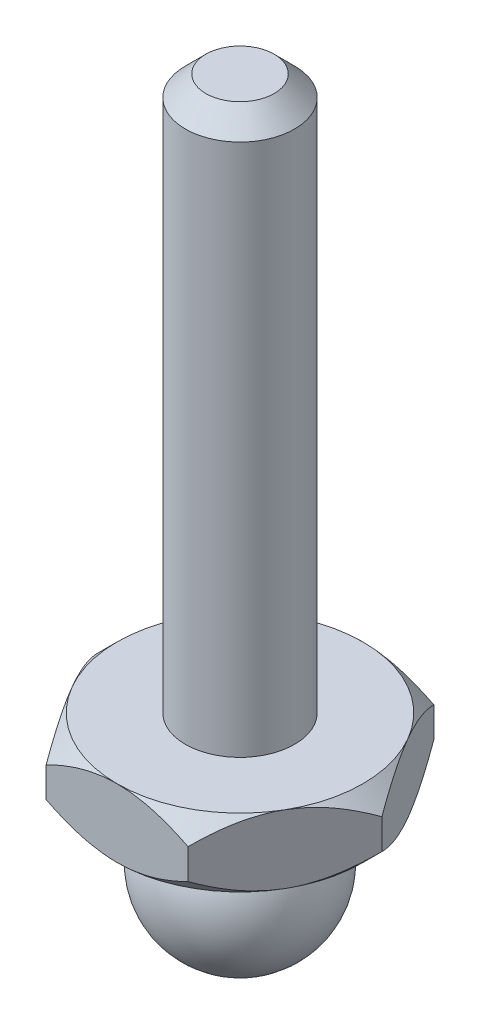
ISO-10303-21;
HEADER;
FILE_DESCRIPTION(('STEP AP214'),'2;1');
FILE_NAME('part.step','',(''),(''),'','','');
FILE_SCHEMA(('AUTOMOTIVE_DESIGN { 1 0 10303 214 1 1 1 1 }'));
ENDSEC;
DATA;
#1=APPLICATION_CONTEXT('core data for automotive mechanical design processes');
#2=APPLICATION_PROTOCOL_DEFINITION('international standard','automotive_design',2000,#1);
#3=PRODUCT_CONTEXT('',#1,'mechanical');
#4=PRODUCT('Part','Part','',(#3));
#5=PRODUCT_RELATED_PRODUCT_CATEGORY('part','',(#4));
#6=PRODUCT_DEFINITION_FORMATION('','',#4);
#7=PRODUCT_DEFINITION_CONTEXT('part definition',#1,'design');
#8=PRODUCT_DEFINITION('design','',#6,#7);
#9=PRODUCT_DEFINITION_SHAPE('','',#8);
#10=(LENGTH_UNIT() NAMED_UNIT(*) SI_UNIT(.MILLI.,.METRE.));
#11=(NAMED_UNIT(*) PLANE_ANGLE_UNIT() SI_UNIT($,.RADIAN.));
#12=(NAMED_UNIT(*) SI_UNIT($,.STERADIAN.) SOLID_ANGLE_UNIT());
#13=UNCERTAINTY_MEASURE_WITH_UNIT(LENGTH_MEASURE(1.E-05),#10,'distance_accuracy_value','');
#14=(GEOMETRIC_REPRESENTATION_CONTEXT(3) GLOBAL_UNCERTAINTY_ASSIGNED_CONTEXT((#13)) GLOBAL_UNIT_ASSIGNED_CONTEXT((#10,
#11,#12)) REPRESENTATION_CONTEXT('',''));
#15=CARTESIAN_POINT('',(0.,0.,0.));
#16=DIRECTION('',(0.,0.,1.));
#17=DIRECTION('',(1.,0.,0.));
#18=AXIS2_PLACEMENT_3D('',#15,#16,#17);
#19=CARTESIAN_POINT('',(-5.19615242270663,9.47213595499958,9.));
#20=DIRECTION('',(0.,0.,-1.));
#21=DIRECTION('',(-1.,0.,0.));
#22=AXIS2_PLACEMENT_3D('',#19,#20,#21);
#23=PLANE('',#22);
#24=CARTESIAN_POINT('',(-11.0908342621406,9.75522401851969,9.));
#25=CARTESIAN_POINT('',(-10.8238091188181,9.54792490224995,9.));
#26=CARTESIAN_POINT('',(-10.5553736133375,9.34241445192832,9.));
#27=CARTESIAN_POINT('',(-10.0150955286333,8.93579607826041,9.));
#28=CARTESIAN_POINT('',(-9.7432521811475,8.7346891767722,9.));
#29=CARTESIAN_POINT('',(-9.19358931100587,8.33627339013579,9.));
#30=CARTESIAN_POINT('',(-8.91573991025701,8.13900559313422,9.));
#31=CARTESIAN_POINT('',(-8.35546693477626,7.75109935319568,9.));
#32=CARTESIAN_POINT('',(-8.07304367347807,7.56046045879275,9.));
#33=CARTESIAN_POINT('',(-7.48382620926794,7.17490199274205,9.));
#34=CARTESIAN_POINT('',(-7.17666248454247,6.98054431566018,9.));
#35=CARTESIAN_POINT('',(-6.55510796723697,6.60354914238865,9.));
#36=CARTESIAN_POINT('',(-6.24071593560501,6.42091367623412,9.));
#37=CARTESIAN_POINT('',(-5.60456120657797,6.07122564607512,9.));
#38=CARTESIAN_POINT('',(-5.28282380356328,5.90412742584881,9.));
#39=CARTESIAN_POINT('',(-4.63010105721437,5.58925831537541,9.));
#40=CARTESIAN_POINT('',(-4.29912025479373,5.44147813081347,9.));
#41=CARTESIAN_POINT('',(-3.66309366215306,5.18516526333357,9.));
#42=CARTESIAN_POINT('',(-3.35906917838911,5.07412385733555,9.));
#43=CARTESIAN_POINT('',(-2.74306331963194,4.8763581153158,9.));
#44=CARTESIAN_POINT('',(-2.43108145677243,4.78963527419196,9.));
#45=CARTESIAN_POINT('',(-1.80658766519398,4.64673760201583,9.));
#46=CARTESIAN_POINT('',(-1.4942087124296,4.58999155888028,9.));
#47=CARTESIAN_POINT('',(-0.865298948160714,4.50826824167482,9.));
#48=CARTESIAN_POINT('',(-0.548769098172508,4.48328373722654,9.));
#49=CARTESIAN_POINT('',(0.0699839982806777,4.46734839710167,9.));
#50=CARTESIAN_POINT('',(0.372166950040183,4.47482599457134,9.00000000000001));
#51=CARTESIAN_POINT('',(0.974283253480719,4.51973478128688,9.00000000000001));
#52=CARTESIAN_POINT('',(1.27421640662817,4.55716858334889,9.00000000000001));
#53=CARTESIAN_POINT('',(1.87475535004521,4.66047166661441,9.00000000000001));
#54=CARTESIAN_POINT('',(2.17527160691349,4.72685243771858,9.00000000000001));
#55=CARTESIAN_POINT('',(2.76964399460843,4.88429361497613,9.00000000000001));
#56=CARTESIAN_POINT('',(3.06350040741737,4.97535297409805,9.00000000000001));
#57=CARTESIAN_POINT('',(3.65606933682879,5.18226022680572,9.00000000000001));
#58=CARTESIAN_POINT('',(3.95447213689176,5.2989845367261,9.00000000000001));
#59=CARTESIAN_POINT('',(4.54362888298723,5.55050580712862,9.00000000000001));
#60=CARTESIAN_POINT('',(4.83437935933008,5.68531080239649,9.00000000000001));
#61=CARTESIAN_POINT('',(5.40958599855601,5.96979946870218,9.00000000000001));
#62=CARTESIAN_POINT('',(5.69401950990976,6.1195285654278,9.00000000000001));
#63=CARTESIAN_POINT('',(6.25637904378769,6.43057648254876,9.00000000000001));
#64=CARTESIAN_POINT('',(6.53430604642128,6.59189354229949,9.00000000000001));
#65=CARTESIAN_POINT('',(7.07094073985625,6.91568090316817,9.00000000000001));
#66=CARTESIAN_POINT('',(7.32992057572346,7.07770254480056,9.00000000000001));
#67=CARTESIAN_POINT('',(7.84342991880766,7.40867133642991,9.00000000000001));
#68=CARTESIAN_POINT('',(8.09795909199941,7.57761900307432,9.00000000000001));
#69=CARTESIAN_POINT('',(8.60111065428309,7.91983863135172,9.00000000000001));
#70=CARTESIAN_POINT('',(8.84976398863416,8.09306525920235,9.00000000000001));
#71=CARTESIAN_POINT('',(9.3436551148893,8.44418417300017,9.00000000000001));
#72=CARTESIAN_POINT('',(9.58889382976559,8.62207515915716,9.00000000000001));
#73=CARTESIAN_POINT('',(9.83269925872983,8.80187618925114,9.00000000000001));
#74=B_SPLINE_CURVE_WITH_KNOTS('',3,(#24,#25,#26,#27,#28,#29,#30,#31,#32,#33,#34,#35,#36,#37,#38,
#39,#40,#41,#42,#43,#44,#45,#46,#47,#48,#49,#50,#51,#52,#53,#54,#55,#56,#57,#58,#59,#60,#61,#62,
#63,#64,#65,#66,#67,#68,#69,#70,#71,#72,#73),.UNSPECIFIED.,.F.,.F.,(4,2,2,2,2,2,2,2,2,2,2,2,2,2,
2,2,2,2,2,2,2,2,2,2,4),(0.,1.01415701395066,2.02854692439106,3.05073583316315,4.07285498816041,
5.16311489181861,6.25356309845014,7.3406984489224,8.42730881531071,9.39748376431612,
10.3677183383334,11.3187293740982,12.2695238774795,13.1748150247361,14.0801851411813,
15.0022458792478,15.9242675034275,16.8847951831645,17.8457511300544,18.8097269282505,
19.7735565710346,20.6898849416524,21.6062817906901,22.5153570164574,23.4241815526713),.UNSPECIFIED.);
#75=CARTESIAN_POINT('',(5.19615242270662,5.86444080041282,9.00000000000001));
#76=VERTEX_POINT('',#75);
#77=CARTESIAN_POINT('',(0.,4.47213595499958,9.00000000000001));
#78=VERTEX_POINT('',#77);
#79=EDGE_CURVE('E137',#76,#78,#74,.F.);
#80=ORIENTED_EDGE('',*,*,#79,.F.);
#81=DIRECTION('',(0.,-1.,0.));
#82=VECTOR('',#81,1.);
#83=CARTESIAN_POINT('',(5.19615242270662,9.47213595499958,9.00000000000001));
#84=LINE('',#83,#82);
#85=CARTESIAN_POINT('',(5.19615242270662,8.07983110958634,9.00000000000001));
#86=VERTEX_POINT('',#85);
#87=EDGE_CURVE('E465',#86,#76,#84,.T.);
#88=ORIENTED_EDGE('',*,*,#87,.F.);
#89=CARTESIAN_POINT('',(-11.0908342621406,4.18904789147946,9.));
#90=CARTESIAN_POINT('',(-10.8238091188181,4.39634700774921,9.));
#91=CARTESIAN_POINT('',(-10.5553736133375,4.60185745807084,9.));
#92=CARTESIAN_POINT('',(-10.0150955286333,5.00847583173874,9.));
#93=CARTESIAN_POINT('',(-9.7432521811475,5.20958273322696,9.));
#94=CARTESIAN_POINT('',(-9.19358931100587,5.60799851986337,9.));
#95=CARTESIAN_POINT('',(-8.91573991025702,5.80526631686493,9.));
#96=CARTESIAN_POINT('',(-8.35546693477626,6.19317255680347,9.));
#97=CARTESIAN_POINT('',(-8.07304367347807,6.3838114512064,9.));
#98=CARTESIAN_POINT('',(-7.48382620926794,6.76936991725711,9.));
#99=CARTESIAN_POINT('',(-7.17666248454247,6.96372759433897,9.));
#100=CARTESIAN_POINT('',(-6.55510796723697,7.34072276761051,9.));
#101=CARTESIAN_POINT('',(-6.24071593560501,7.52335823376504,9.));
#102=CARTESIAN_POINT('',(-5.60456120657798,7.87304626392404,9.));
#103=CARTESIAN_POINT('',(-5.28282380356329,8.04014448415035,9.));
#104=CARTESIAN_POINT('',(-4.63010105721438,8.35501359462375,9.));
#105=CARTESIAN_POINT('',(-4.29912025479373,8.50279377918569,9.));
#106=CARTESIAN_POINT('',(-3.66309366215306,8.75910664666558,9.));
#107=CARTESIAN_POINT('',(-3.35906917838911,8.87014805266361,9.));
#108=CARTESIAN_POINT('',(-2.74306331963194,9.06791379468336,9.));
#109=CARTESIAN_POINT('',(-2.43108145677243,9.1546366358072,9.));
#110=CARTESIAN_POINT('',(-1.80658766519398,9.29753430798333,9.));
#111=CARTESIAN_POINT('',(-1.49420871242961,9.35428035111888,9.));
#112=CARTESIAN_POINT('',(-0.865298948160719,9.43600366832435,9.));
#113=CARTESIAN_POINT('',(-0.548769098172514,9.46098817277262,9.));
#114=CARTESIAN_POINT('',(0.0699839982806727,9.47692351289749,9.));
#115=CARTESIAN_POINT('',(0.372166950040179,9.46944591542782,9.00000000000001));
#116=CARTESIAN_POINT('',(0.974283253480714,9.42453712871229,9.00000000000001));
#117=CARTESIAN_POINT('',(1.27421640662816,9.38710332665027,9.00000000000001));
#118=CARTESIAN_POINT('',(1.87475535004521,9.28380024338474,9.00000000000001));
#119=CARTESIAN_POINT('',(2.17527160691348,9.21741947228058,9.00000000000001));
#120=CARTESIAN_POINT('',(2.76964399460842,9.05997829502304,9.00000000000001));
#121=CARTESIAN_POINT('',(3.06350040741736,8.96891893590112,9.00000000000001));
#122=CARTESIAN_POINT('',(3.65606933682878,8.76201168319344,9.00000000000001));
#123=CARTESIAN_POINT('',(3.95447213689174,8.64528737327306,9.00000000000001));
#124=CARTESIAN_POINT('',(4.54362888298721,8.39376610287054,9.00000000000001));
#125=CARTESIAN_POINT('',(4.83437935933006,8.25896110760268,9.00000000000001));
#126=CARTESIAN_POINT('',(5.40958599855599,7.97447244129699,9.00000000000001));
#127=CARTESIAN_POINT('',(5.69401950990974,7.82474334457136,9.00000000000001));
#128=CARTESIAN_POINT('',(6.25637904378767,7.51369542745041,9.00000000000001));
#129=CARTESIAN_POINT('',(6.53430604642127,7.35237836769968,9.00000000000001));
#130=CARTESIAN_POINT('',(7.07094073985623,7.028591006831,9.00000000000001));
#131=CARTESIAN_POINT('',(7.32992057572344,6.86656936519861,9.00000000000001));
#132=CARTESIAN_POINT('',(7.84342991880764,6.53560057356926,9.00000000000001));
#133=CARTESIAN_POINT('',(8.09795909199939,6.36665290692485,9.00000000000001));
#134=CARTESIAN_POINT('',(8.60111065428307,6.02443327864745,9.00000000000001));
#135=CARTESIAN_POINT('',(8.84976398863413,5.85120665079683,9.00000000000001));
#136=CARTESIAN_POINT('',(9.34365511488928,5.50008773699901,9.00000000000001));
#137=CARTESIAN_POINT('',(9.58889382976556,5.32219675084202,9.00000000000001));
#138=CARTESIAN_POINT('',(9.83269925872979,5.14239572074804,9.00000000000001));
#139=B_SPLINE_CURVE_WITH_KNOTS('',3,(#89,#90,#91,#92,#93,#94,#95,#96,#97,#98,#99,#100,#101,#102,
#103,#104,#105,#106,#107,#108,#109,#110,#111,#112,#113,#114,#115,#116,#117,#118,#119,#120,#121,
#122,#123,#124,#125,#126,#127,#128,#129,#130,#131,#132,#133,#134,#135,#136,#137,#138),
.UNSPECIFIED.,.F.,.F.,(4,2,2,2,2,2,2,2,2,2,2,2,2,2,2,2,2,2,2,2,2,2,2,2,4),(0.,1.01415701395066,
2.02854692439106,3.05073583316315,4.07285498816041,5.1631148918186,6.25356309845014,
7.3406984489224,8.42730881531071,9.39748376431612,10.3677183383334,11.3187293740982,
12.2695238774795,13.1748150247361,14.0801851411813,15.0022458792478,15.9242675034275,
16.8847951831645,17.8457511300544,18.8097269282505,19.7735565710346,20.6898849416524,
21.6062817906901,22.5153570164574,23.4241815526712),.UNSPECIFIED.);
#140=CARTESIAN_POINT('',(0.,9.47213595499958,9.));
#141=VERTEX_POINT('',#140);
#142=EDGE_CURVE('E440',#141,#86,#139,.T.);
#143=ORIENTED_EDGE('',*,*,#142,.F.);
#144=CARTESIAN_POINT('',(-5.19615242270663,8.07983110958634,9.));
#145=VERTEX_POINT('',#144);
#146=EDGE_CURVE('E438',#145,#141,#139,.T.);
#147=ORIENTED_EDGE('',*,*,#146,.F.);
#148=DIRECTION('',(0.,-1.,0.));
#149=VECTOR('',#148,1.);
#150=CARTESIAN_POINT('',(-5.19615242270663,9.47213595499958,9.));
#151=LINE('',#150,#149);
#152=CARTESIAN_POINT('',(-5.19615242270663,5.86444080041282,9.));
#153=VERTEX_POINT('',#152);
#154=EDGE_CURVE('E149',#145,#153,#151,.T.);
#155=ORIENTED_EDGE('',*,*,#154,.T.);
#156=EDGE_CURVE('E124',#78,#153,#74,.F.);
#157=ORIENTED_EDGE('',*,*,#156,.F.);
#158=EDGE_LOOP('',(#80,#88,#143,#147,#155,#157));
#159=FACE_BOUND('',#158,.T.);
#160=ADVANCED_FACE('F30',(#159),#23,.F.);
#161=CARTESIAN_POINT('',(-10.3923048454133,9.47213595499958,0.));
#162=DIRECTION('',(0.866025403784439,0.,-0.5));
#163=DIRECTION('',(-0.5,0.,-0.866025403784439));
#164=AXIS2_PLACEMENT_3D('',#161,#162,#163);
#165=PLANE('',#164);
#166=CARTESIAN_POINT('',(-5.19603695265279,5.86455627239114,9.0002));
#167=CARTESIAN_POINT('',(-5.28537108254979,5.77523459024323,8.84546874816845));
#168=CARTESIAN_POINT('',(-5.37540484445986,5.68863850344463,8.68952569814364));
#169=CARTESIAN_POINT('',(-5.5569805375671,5.52176331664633,8.37502737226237));
#170=CARTESIAN_POINT('',(-5.64852325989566,5.44148766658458,8.21647072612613));
#171=CARTESIAN_POINT('',(-5.83365756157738,5.28777917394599,7.89580870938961));
#172=CARTESIAN_POINT('',(-5.92725787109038,5.21438814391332,7.73368821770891));
#173=CARTESIAN_POINT('',(-6.11599584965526,5.07604288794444,7.4067844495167));
#174=CARTESIAN_POINT('',(-6.21113328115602,5.01108737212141,7.24200158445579));
#175=CARTESIAN_POINT('',(-6.40141583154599,4.89166836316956,6.91242253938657));
#176=CARTESIAN_POINT('',(-6.49653756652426,4.83705668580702,6.74766686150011));
#177=CARTESIAN_POINT('',(-6.68811448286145,4.73818723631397,6.41584590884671));
#178=CARTESIAN_POINT('',(-6.78456951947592,4.69392834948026,6.24878088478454));
#179=CARTESIAN_POINT('',(-6.97840046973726,4.6168787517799,5.91305583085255));
#180=CARTESIAN_POINT('',(-7.07577379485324,4.58406222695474,5.74440028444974));
#181=CARTESIAN_POINT('',(-7.2713379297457,4.53061845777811,5.40567326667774));
#182=CARTESIAN_POINT('',(-7.36952861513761,4.50998939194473,5.23560201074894));
#183=CARTESIAN_POINT('',(-7.60881036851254,4.47540033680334,4.82115385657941));
#184=CARTESIAN_POINT('',(-7.75016006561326,4.46814177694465,4.57632899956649));
#185=CARTESIAN_POINT('',(-8.03260382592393,4.4803246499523,4.08712205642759));
#186=CARTESIAN_POINT('',(-8.17369778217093,4.4997754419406,3.84274015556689));
#187=CARTESIAN_POINT('',(-8.45455567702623,4.56422892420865,3.35628001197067));
#188=CARTESIAN_POINT('',(-8.5943179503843,4.60926018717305,3.11420465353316));
#189=CARTESIAN_POINT('',(-8.87144025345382,4.72242685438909,2.63421474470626));
#190=CARTESIAN_POINT('',(-9.00880046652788,4.7905604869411,2.3962998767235));
#191=CARTESIAN_POINT('',(-9.25263415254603,4.93072902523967,1.97396754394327));
#192=CARTESIAN_POINT('',(-9.35964764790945,4.99907688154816,1.78861473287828));
#193=CARTESIAN_POINT('',(-9.57175371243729,5.1467861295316,1.42123625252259));
#194=CARTESIAN_POINT('',(-9.67684622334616,5.22614785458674,1.23921068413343));
#195=CARTESIAN_POINT('',(-9.88477930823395,5.39410596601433,0.879060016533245));
#196=CARTESIAN_POINT('',(-9.9876257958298,5.48267331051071,0.700924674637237));
#197=CARTESIAN_POINT('',(-10.1914144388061,5.66787999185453,0.34795239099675));
#198=CARTESIAN_POINT('',(-10.2923577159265,5.76451437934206,0.173113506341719));
#199=CARTESIAN_POINT('',(-10.3924203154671,5.86455627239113,-0.000200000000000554));
#200=B_SPLINE_CURVE_WITH_KNOTS('',3,(#166,#167,#168,#169,#170,#171,#172,#173,#174,#175,#176,
#177,#178,#179,#180,#181,#182,#183,#184,#185,#186,#187,#188,#189,#190,#191,#192,#193,#194,#195,
#196,#197,#198,#199),.UNSPECIFIED.,.F.,.F.,(4,2,2,2,2,2,2,2,2,2,2,2,2,2,2,2,4),(0.,
0.599280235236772,1.19888534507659,1.80192368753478,2.40486970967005,2.99838724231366,
3.59184084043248,4.18394681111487,4.77596426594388,5.62301971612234,6.47037205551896,
7.31867273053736,8.16690836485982,8.84061799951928,9.51434803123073,10.1860136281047,
10.8572701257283),.UNSPECIFIED.);
#201=CARTESIAN_POINT('',(-7.79422863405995,4.47213595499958,4.49999999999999));
#202=VERTEX_POINT('',#201);
#203=EDGE_CURVE('E126',#153,#202,#200,.T.);
#204=ORIENTED_EDGE('',*,*,#203,.F.);
#205=ORIENTED_EDGE('',*,*,#154,.F.);
#206=CARTESIAN_POINT('',(-10.3924203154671,8.07971563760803,-0.000200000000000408));
#207=CARTESIAN_POINT('',(-10.3030861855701,8.16903731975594,0.154531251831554));
#208=CARTESIAN_POINT('',(-10.21305242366,8.25563340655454,0.310474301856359));
#209=CARTESIAN_POINT('',(-10.0314767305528,8.42250859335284,0.624972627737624));
#210=CARTESIAN_POINT('',(-9.93993400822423,8.50278424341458,0.783529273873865));
#211=CARTESIAN_POINT('',(-9.75479970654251,8.65649273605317,1.10419129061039));
#212=CARTESIAN_POINT('',(-9.66119939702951,8.72988376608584,1.26631178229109));
#213=CARTESIAN_POINT('',(-9.47246141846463,8.86822902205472,1.59321555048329));
#214=CARTESIAN_POINT('',(-9.37732398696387,8.93318453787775,1.75799841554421));
#215=CARTESIAN_POINT('',(-9.18704143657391,9.0526035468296,2.08757746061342));
#216=CARTESIAN_POINT('',(-9.09191970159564,9.10721522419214,2.25233313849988));
#217=CARTESIAN_POINT('',(-8.90034278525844,9.20608467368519,2.58415409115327));
#218=CARTESIAN_POINT('',(-8.80388774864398,9.2503435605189,2.75121911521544));
#219=CARTESIAN_POINT('',(-8.61005679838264,9.32739315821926,3.08694416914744));
#220=CARTESIAN_POINT('',(-8.51268347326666,9.36020968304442,3.25559971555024));
#221=CARTESIAN_POINT('',(-8.31711933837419,9.41365345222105,3.59432673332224));
#222=CARTESIAN_POINT('',(-8.21892865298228,9.43428251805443,3.76439798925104));
#223=CARTESIAN_POINT('',(-7.97964689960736,9.46887157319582,4.17884614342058));
#224=CARTESIAN_POINT('',(-7.83829720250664,9.47613013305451,4.42367100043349));
#225=CARTESIAN_POINT('',(-7.55585344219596,9.46394726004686,4.91287794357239));
#226=CARTESIAN_POINT('',(-7.41475948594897,9.44449646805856,5.15725984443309));
#227=CARTESIAN_POINT('',(-7.13390159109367,9.38004298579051,5.64371998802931));
#228=CARTESIAN_POINT('',(-6.99413931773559,9.33501172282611,5.88579534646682));
#229=CARTESIAN_POINT('',(-6.71701701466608,9.22184505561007,6.36578525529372));
#230=CARTESIAN_POINT('',(-6.57965680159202,9.15371142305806,6.60370012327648));
#231=CARTESIAN_POINT('',(-6.33582311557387,9.01354288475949,7.02603245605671));
#232=CARTESIAN_POINT('',(-6.22880962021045,8.945195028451,7.2113852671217));
#233=CARTESIAN_POINT('',(-6.01670355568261,8.79748578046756,7.5787637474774));
#234=CARTESIAN_POINT('',(-5.91161104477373,8.71812405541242,7.76078931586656));
#235=CARTESIAN_POINT('',(-5.70367795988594,8.55016594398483,8.12093998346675));
#236=CARTESIAN_POINT('',(-5.60083147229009,8.46159859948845,8.29907532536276));
#237=CARTESIAN_POINT('',(-5.39704282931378,8.27639191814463,8.65204760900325));
#238=CARTESIAN_POINT('',(-5.29609955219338,8.17975753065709,8.82688649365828));
#239=CARTESIAN_POINT('',(-5.19603695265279,8.07971563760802,9.0002));
#240=B_SPLINE_CURVE_WITH_KNOTS('',3,(#206,#207,#208,#209,#210,#211,#212,#213,#214,#215,#216,
#217,#218,#219,#220,#221,#222,#223,#224,#225,#226,#227,#228,#229,#230,#231,#232,#233,#234,#235,
#236,#237,#238,#239),.UNSPECIFIED.,.F.,.F.,(4,2,2,2,2,2,2,2,2,2,2,2,2,2,2,2,4),(0.,
0.59928023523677,1.19888534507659,1.80192368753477,2.40486970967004,2.99838724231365,
3.59184084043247,4.18394681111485,4.77596426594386,5.62301971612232,6.47037205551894,
7.31867273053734,8.16690836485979,8.84061799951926,9.51434803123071,10.1860136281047,
10.8572701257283),.UNSPECIFIED.);
#241=CARTESIAN_POINT('',(-7.79422863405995,9.47213595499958,4.49999999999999));
#242=VERTEX_POINT('',#241);
#243=EDGE_CURVE('E216',#242,#145,#240,.T.);
#244=ORIENTED_EDGE('',*,*,#243,.F.);
#245=CARTESIAN_POINT('',(-10.3923048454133,8.07983110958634,0.));
#246=VERTEX_POINT('',#245);
#247=EDGE_CURVE('E221',#246,#242,#240,.T.);
#248=ORIENTED_EDGE('',*,*,#247,.F.);
#249=DIRECTION('',(0.,-1.,0.));
#250=VECTOR('',#249,1.);
#251=CARTESIAN_POINT('',(-10.3923048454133,9.47213595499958,0.));
#252=LINE('',#251,#250);
#253=CARTESIAN_POINT('',(-10.3923048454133,5.86444080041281,0.));
#254=VERTEX_POINT('',#253);
#255=EDGE_CURVE('E461',#246,#254,#252,.T.);
#256=ORIENTED_EDGE('',*,*,#255,.T.);
#257=EDGE_CURVE('E195',#202,#254,#200,.T.);
#258=ORIENTED_EDGE('',*,*,#257,.F.);
#259=EDGE_LOOP('',(#204,#205,#244,#248,#256,#258));
#260=FACE_BOUND('',#259,.T.);
#261=ADVANCED_FACE('F206',(#260),#165,.F.);
#262=CARTESIAN_POINT('',(-5.19615242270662,9.47213595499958,-9.));
#263=DIRECTION('',(0.866025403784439,0.,0.5));
#264=DIRECTION('',(0.5,0.,-0.866025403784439));
#265=AXIS2_PLACEMENT_3D('',#262,#263,#264);
#266=PLANE('',#265);
#267=CARTESIAN_POINT('',(-10.3924203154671,5.86455627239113,0.000199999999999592));
#268=CARTESIAN_POINT('',(-10.3030861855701,5.77523459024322,-0.154531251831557));
#269=CARTESIAN_POINT('',(-10.21305242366,5.68863850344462,-0.310474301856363));
#270=CARTESIAN_POINT('',(-10.0314767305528,5.52176331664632,-0.624972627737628));
#271=CARTESIAN_POINT('',(-9.93993400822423,5.44148766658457,-0.783529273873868));
#272=CARTESIAN_POINT('',(-9.75479970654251,5.28777917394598,-1.10419129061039));
#273=CARTESIAN_POINT('',(-9.6611993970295,5.21438814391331,-1.26631178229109));
#274=CARTESIAN_POINT('',(-9.47246141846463,5.07604288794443,-1.5932155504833));
#275=CARTESIAN_POINT('',(-9.37732398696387,5.0110873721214,-1.75799841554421));
#276=CARTESIAN_POINT('',(-9.1870414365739,4.89166836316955,-2.08757746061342));
#277=CARTESIAN_POINT('',(-9.09191970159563,4.83705668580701,-2.25233313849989));
#278=CARTESIAN_POINT('',(-8.90034278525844,4.73818723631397,-2.58415409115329));
#279=CARTESIAN_POINT('',(-8.80388774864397,4.69392834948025,-2.75121911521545));
#280=CARTESIAN_POINT('',(-8.61005679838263,4.6168787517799,-3.08694416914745));
#281=CARTESIAN_POINT('',(-8.51268347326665,4.58406222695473,-3.25559971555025));
#282=CARTESIAN_POINT('',(-8.31711933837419,4.5306184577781,-3.59432673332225));
#283=CARTESIAN_POINT('',(-8.21892865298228,4.50998939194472,-3.76439798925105));
#284=CARTESIAN_POINT('',(-7.97964689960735,4.47540033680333,-4.17884614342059));
#285=CARTESIAN_POINT('',(-7.83829720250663,4.46814177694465,-4.4236710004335));
#286=CARTESIAN_POINT('',(-7.55585344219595,4.48032464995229,-4.91287794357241));
#287=CARTESIAN_POINT('',(-7.41475948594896,4.4997754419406,-5.1572598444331));
#288=CARTESIAN_POINT('',(-7.13390159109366,4.56422892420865,-5.64371998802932));
#289=CARTESIAN_POINT('',(-6.99413931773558,4.60926018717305,-5.88579534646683));
#290=CARTESIAN_POINT('',(-6.71701701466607,4.72242685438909,-6.36578525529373));
#291=CARTESIAN_POINT('',(-6.57965680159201,4.7905604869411,-6.60370012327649));
#292=CARTESIAN_POINT('',(-6.33582311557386,4.93072902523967,-7.02603245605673));
#293=CARTESIAN_POINT('',(-6.22880962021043,4.99907688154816,-7.21138526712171));
#294=CARTESIAN_POINT('',(-6.0167035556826,5.1467861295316,-7.57876374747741));
#295=CARTESIAN_POINT('',(-5.91161104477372,5.22614785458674,-7.76078931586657));
#296=CARTESIAN_POINT('',(-5.70367795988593,5.39410596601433,-8.12093998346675));
#297=CARTESIAN_POINT('',(-5.60083147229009,5.48267331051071,-8.29907532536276));
#298=CARTESIAN_POINT('',(-5.39704282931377,5.66787999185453,-8.65204760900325));
#299=CARTESIAN_POINT('',(-5.29609955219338,5.76451437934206,-8.82688649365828));
#300=CARTESIAN_POINT('',(-5.19603695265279,5.86455627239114,-9.0002));
#301=B_SPLINE_CURVE_WITH_KNOTS('',3,(#267,#268,#269,#270,#271,#272,#273,#274,#275,#276,#277,
#278,#279,#280,#281,#282,#283,#284,#285,#286,#287,#288,#289,#290,#291,#292,#293,#294,#295,#296,
#297,#298,#299,#300),.UNSPECIFIED.,.F.,.F.,(4,2,2,2,2,2,2,2,2,2,2,2,2,2,2,2,4),(0.,
0.599280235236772,1.19888534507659,1.80192368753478,2.40486970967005,2.99838724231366,
3.59184084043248,4.18394681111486,4.77596426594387,5.62301971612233,6.47037205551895,
7.31867273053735,8.16690836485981,8.84061799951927,9.51434803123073,10.1860136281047,
10.8572701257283),.UNSPECIFIED.);
#302=CARTESIAN_POINT('',(-7.79422863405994,4.47213595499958,-4.5));
#303=VERTEX_POINT('',#302);
#304=EDGE_CURVE('E200',#254,#303,#301,.T.);
#305=ORIENTED_EDGE('',*,*,#304,.F.);
#306=ORIENTED_EDGE('',*,*,#255,.F.);
#307=CARTESIAN_POINT('',(-5.19603695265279,8.07971563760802,-9.0002));
#308=CARTESIAN_POINT('',(-5.28537108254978,8.16903731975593,-8.84546874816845));
#309=CARTESIAN_POINT('',(-5.37540484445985,8.25563340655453,-8.68952569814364));
#310=CARTESIAN_POINT('',(-5.55698053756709,8.42250859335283,-8.37502737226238));
#311=CARTESIAN_POINT('',(-5.64852325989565,8.50278424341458,-8.21647072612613));
#312=CARTESIAN_POINT('',(-5.83365756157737,8.65649273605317,-7.89580870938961));
#313=CARTESIAN_POINT('',(-5.92725787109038,8.72988376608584,-7.73368821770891));
#314=CARTESIAN_POINT('',(-6.11599584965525,8.86822902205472,-7.4067844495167));
#315=CARTESIAN_POINT('',(-6.21113328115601,8.93318453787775,-7.24200158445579));
#316=CARTESIAN_POINT('',(-6.40141583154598,9.0526035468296,-6.91242253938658));
#317=CARTESIAN_POINT('',(-6.49653756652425,9.10721522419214,-6.74766686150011));
#318=CARTESIAN_POINT('',(-6.68811448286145,9.20608467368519,-6.41584590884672));
#319=CARTESIAN_POINT('',(-6.78456951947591,9.2503435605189,-6.24878088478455));
#320=CARTESIAN_POINT('',(-6.97840046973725,9.32739315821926,-5.91305583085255));
#321=CARTESIAN_POINT('',(-7.07577379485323,9.36020968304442,-5.74440028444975));
#322=CARTESIAN_POINT('',(-7.2713379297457,9.41365345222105,-5.40567326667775));
#323=CARTESIAN_POINT('',(-7.3695286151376,9.43428251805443,-5.23560201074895));
#324=CARTESIAN_POINT('',(-7.60881036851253,9.46887157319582,-4.82115385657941));
#325=CARTESIAN_POINT('',(-7.75016006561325,9.47613013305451,-4.5763289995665));
#326=CARTESIAN_POINT('',(-8.03260382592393,9.46394726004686,-4.0871220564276));
#327=CARTESIAN_POINT('',(-8.17369778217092,9.44449646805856,-3.8427401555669));
#328=CARTESIAN_POINT('',(-8.45455567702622,9.38004298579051,-3.35628001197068));
#329=CARTESIAN_POINT('',(-8.5943179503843,9.33501172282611,-3.11420465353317));
#330=CARTESIAN_POINT('',(-8.87144025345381,9.22184505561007,-2.63421474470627));
#331=CARTESIAN_POINT('',(-9.00880046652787,9.15371142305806,-2.39629987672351));
#332=CARTESIAN_POINT('',(-9.25263415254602,9.01354288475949,-1.97396754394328));
#333=CARTESIAN_POINT('',(-9.35964764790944,8.945195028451,-1.78861473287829));
#334=CARTESIAN_POINT('',(-9.57175371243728,8.79748578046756,-1.4212362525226));
#335=CARTESIAN_POINT('',(-9.67684622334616,8.71812405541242,-1.23921068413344));
#336=CARTESIAN_POINT('',(-9.88477930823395,8.55016594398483,-0.879060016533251));
#337=CARTESIAN_POINT('',(-9.98762579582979,8.46159859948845,-0.700924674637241));
#338=CARTESIAN_POINT('',(-10.1914144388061,8.27639191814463,-0.347952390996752));
#339=CARTESIAN_POINT('',(-10.2923577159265,8.1797575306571,-0.17311350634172));
#340=CARTESIAN_POINT('',(-10.3924203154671,8.07971563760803,0.000199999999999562));
#341=B_SPLINE_CURVE_WITH_KNOTS('',3,(#307,#308,#309,#310,#311,#312,#313,#314,#315,#316,#317,
#318,#319,#320,#321,#322,#323,#324,#325,#326,#327,#328,#329,#330,#331,#332,#333,#334,#335,#336,
#337,#338,#339,#340),.UNSPECIFIED.,.F.,.F.,(4,2,2,2,2,2,2,2,2,2,2,2,2,2,2,2,4),(0.,
0.599280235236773,1.19888534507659,1.80192368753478,2.40486970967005,2.99838724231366,
3.59184084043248,4.18394681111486,4.77596426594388,5.62301971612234,6.47037205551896,
7.31867273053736,8.16690836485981,8.84061799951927,9.51434803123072,10.1860136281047,
10.8572701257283),.UNSPECIFIED.);
#342=CARTESIAN_POINT('',(-7.79422863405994,9.47213595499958,-4.5));
#343=VERTEX_POINT('',#342);
#344=EDGE_CURVE('E223',#343,#246,#341,.T.);
#345=ORIENTED_EDGE('',*,*,#344,.F.);
#346=CARTESIAN_POINT('',(-5.19615242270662,8.07983110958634,-9.));
#347=VERTEX_POINT('',#346);
#348=EDGE_CURVE('E228',#347,#343,#341,.T.);
#349=ORIENTED_EDGE('',*,*,#348,.F.);
#350=DIRECTION('',(0.,-1.,0.));
#351=VECTOR('',#350,1.);
#352=CARTESIAN_POINT('',(-5.19615242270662,9.47213595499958,-9.));
#353=LINE('',#352,#351);
#354=CARTESIAN_POINT('',(-5.19615242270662,5.86444080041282,-9.));
#355=VERTEX_POINT('',#354);
#356=EDGE_CURVE('E458',#347,#355,#353,.T.);
#357=ORIENTED_EDGE('',*,*,#356,.T.);
#358=EDGE_CURVE('E189',#303,#355,#301,.T.);
#359=ORIENTED_EDGE('',*,*,#358,.F.);
#360=EDGE_LOOP('',(#305,#306,#345,#349,#357,#359));
#361=FACE_BOUND('',#360,.T.);
#362=ADVANCED_FACE('F209',(#361),#266,.F.);
#363=CARTESIAN_POINT('',(5.19615242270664,9.47213595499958,-9.));
#364=DIRECTION('',(0.,0.,1.));
#365=DIRECTION('',(1.,0.,0.));
#366=AXIS2_PLACEMENT_3D('',#363,#364,#365);
#367=PLANE('',#366);
#368=CARTESIAN_POINT('',(-11.0908342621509,9.75522401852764,-9.00000000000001));
#369=CARTESIAN_POINT('',(-10.8238091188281,9.54792490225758,-9.00000000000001));
#370=CARTESIAN_POINT('',(-10.5553736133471,9.34241445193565,-9.00000000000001));
#371=CARTESIAN_POINT('',(-10.0150955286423,8.93579607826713,-9.00000000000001));
#372=CARTESIAN_POINT('',(-9.74325218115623,8.73468917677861,-9.00000000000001));
#373=CARTESIAN_POINT('',(-9.19358931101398,8.33627339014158,-9.00000000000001));
#374=CARTESIAN_POINT('',(-8.91573991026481,8.13900559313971,-9.00000000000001));
#375=CARTESIAN_POINT('',(-8.35546693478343,7.75109935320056,-9.00000000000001));
#376=CARTESIAN_POINT('',(-8.07304367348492,7.56046045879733,-9.00000000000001));
#377=CARTESIAN_POINT('',(-7.4838262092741,7.17490199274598,-9.00000000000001));
#378=CARTESIAN_POINT('',(-7.17666248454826,6.98054431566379,-9.00000000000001));
#379=CARTESIAN_POINT('',(-6.555107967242,6.60354914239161,-9.00000000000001));
#380=CARTESIAN_POINT('',(-6.24071593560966,6.42091367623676,-9.));
#381=CARTESIAN_POINT('',(-5.60456120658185,6.07122564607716,-9.));
#382=CARTESIAN_POINT('',(-5.28282380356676,5.90412742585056,-9.));
#383=CARTESIAN_POINT('',(-4.63010105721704,5.58925831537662,-9.));
#384=CARTESIAN_POINT('',(-4.29912025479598,5.44147813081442,-9.));
#385=CARTESIAN_POINT('',(-3.66309366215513,5.18516526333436,-9.));
#386=CARTESIAN_POINT('',(-3.35906917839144,5.07412385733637,-9.));
#387=CARTESIAN_POINT('',(-2.74306331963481,4.87635811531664,-9.));
#388=CARTESIAN_POINT('',(-2.43108145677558,4.78963527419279,-9.));
#389=CARTESIAN_POINT('',(-1.80658766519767,4.64673760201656,-9.));
#390=CARTESIAN_POINT('',(-1.49420871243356,4.58999155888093,-9.));
#391=CARTESIAN_POINT('',(-0.865298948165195,4.50826824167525,-9.));
#392=CARTESIAN_POINT('',(-0.548769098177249,4.48328373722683,-9.));
#393=CARTESIAN_POINT('',(0.0699839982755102,4.46734839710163,-9.));
#394=CARTESIAN_POINT('',(0.372166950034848,4.47482599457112,-9.));
#395=CARTESIAN_POINT('',(0.974283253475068,4.51973478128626,-9.));
#396=CARTESIAN_POINT('',(1.27421640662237,4.55716858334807,-9.));
#397=CARTESIAN_POINT('',(1.87475535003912,4.66047166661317,-9.));
#398=CARTESIAN_POINT('',(2.17527160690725,4.72685243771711,-9.));
#399=CARTESIAN_POINT('',(2.76964399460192,4.8842936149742,-9.));
#400=CARTESIAN_POINT('',(3.06350040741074,4.9753529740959,-9.));
#401=CARTESIAN_POINT('',(3.65606933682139,5.18226022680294,-9.));
#402=CARTESIAN_POINT('',(3.95447213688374,5.29898453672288,-9.));
#403=CARTESIAN_POINT('',(4.543628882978,5.55050580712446,-9.));
#404=CARTESIAN_POINT('',(4.83437935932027,5.68531080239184,-9.));
#405=CARTESIAN_POINT('',(5.40958599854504,5.96979946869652,-9.));
#406=CARTESIAN_POINT('',(5.69401950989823,6.11952856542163,-9.));
#407=CARTESIAN_POINT('',(6.25637904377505,6.43057648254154,-9.));
#408=CARTESIAN_POINT('',(6.5343060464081,6.59189354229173,-8.99999999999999));
#409=CARTESIAN_POINT('',(7.07094073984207,6.9156809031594,-8.99999999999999));
#410=CARTESIAN_POINT('',(7.32992057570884,7.07770254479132,-8.99999999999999));
#411=CARTESIAN_POINT('',(7.84342991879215,7.4086713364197,-8.99999999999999));
#412=CARTESIAN_POINT('',(8.09795909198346,7.57761900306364,-8.99999999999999));
#413=CARTESIAN_POINT('',(8.60111065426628,7.91983863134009,-8.99999999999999));
#414=CARTESIAN_POINT('',(8.84976398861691,8.09306525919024,-8.99999999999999));
#415=CARTESIAN_POINT('',(9.3436551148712,8.44418417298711,-8.99999999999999));
#416=CARTESIAN_POINT('',(9.58889382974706,8.62207515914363,-8.99999999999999));
#417=CARTESIAN_POINT('',(9.83269925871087,8.80187618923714,-8.99999999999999));
#418=B_SPLINE_CURVE_WITH_KNOTS('',3,(#368,#369,#370,#371,#372,#373,#374,#375,#376,#377,#378,
#379,#380,#381,#382,#383,#384,#385,#386,#387,#388,#389,#390,#391,#392,#393,#394,#395,#396,#397,
#398,#399,#400,#401,#402,#403,#404,#405,#406,#407,#408,#409,#410,#411,#412,#413,#414,#415,#416,
#417),.UNSPECIFIED.,.F.,.F.,(4,2,2,2,2,2,2,2,2,2,2,2,2,2,2,2,2,2,2,2,2,2,2,2,4),(0.,
1.01415701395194,2.02854692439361,3.050735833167,4.07285498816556,5.16311489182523,
6.25356309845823,7.34069844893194,8.42730881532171,9.39748376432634,10.3677183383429,
11.3187293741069,12.2695238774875,13.1748150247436,14.0801851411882,15.0022458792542,
15.9242675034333,16.8847951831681,17.8457511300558,18.8097269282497,19.7735565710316,
20.6898849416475,21.6062817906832,22.5153570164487,23.4241815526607),.UNSPECIFIED.);
#419=CARTESIAN_POINT('',(0.,4.47213595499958,-9.));
#420=VERTEX_POINT('',#419);
#421=EDGE_CURVE('E510',#355,#420,#418,.T.);
#422=ORIENTED_EDGE('',*,*,#421,.F.);
#423=ORIENTED_EDGE('',*,*,#356,.F.);
#424=CARTESIAN_POINT('',(-11.0908342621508,4.18904789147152,-9.00000000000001));
#425=CARTESIAN_POINT('',(-10.8238091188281,4.39634700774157,-9.00000000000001));
#426=CARTESIAN_POINT('',(-10.5553736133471,4.60185745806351,-9.00000000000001));
#427=CARTESIAN_POINT('',(-10.0150955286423,5.00847583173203,-9.00000000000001));
#428=CARTESIAN_POINT('',(-9.74325218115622,5.20958273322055,-9.00000000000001));
#429=CARTESIAN_POINT('',(-9.19358931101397,5.60799851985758,-9.00000000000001));
#430=CARTESIAN_POINT('',(-8.9157399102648,5.80526631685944,-9.00000000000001));
#431=CARTESIAN_POINT('',(-8.35546693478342,6.1931725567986,-9.00000000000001));
#432=CARTESIAN_POINT('',(-8.07304367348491,6.38381145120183,-9.00000000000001));
#433=CARTESIAN_POINT('',(-7.48382620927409,6.76936991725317,-9.00000000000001));
#434=CARTESIAN_POINT('',(-7.17666248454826,6.96372759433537,-9.00000000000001));
#435=CARTESIAN_POINT('',(-6.555107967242,7.34072276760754,-9.00000000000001));
#436=CARTESIAN_POINT('',(-6.24071593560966,7.52335823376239,-9.));
#437=CARTESIAN_POINT('',(-5.60456120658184,7.87304626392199,-9.));
#438=CARTESIAN_POINT('',(-5.28282380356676,8.04014448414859,-9.));
#439=CARTESIAN_POINT('',(-4.63010105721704,8.35501359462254,-9.));
#440=CARTESIAN_POINT('',(-4.29912025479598,8.50279377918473,-9.));
#441=CARTESIAN_POINT('',(-3.66309366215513,8.7591066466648,-9.));
#442=CARTESIAN_POINT('',(-3.35906917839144,8.87014805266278,-9.));
#443=CARTESIAN_POINT('',(-2.74306331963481,9.06791379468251,-9.));
#444=CARTESIAN_POINT('',(-2.43108145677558,9.15463663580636,-9.));
#445=CARTESIAN_POINT('',(-1.80658766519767,9.29753430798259,-9.));
#446=CARTESIAN_POINT('',(-1.49420871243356,9.35428035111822,-9.));
#447=CARTESIAN_POINT('',(-0.8652989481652,9.43600366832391,-9.));
#448=CARTESIAN_POINT('',(-0.548769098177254,9.46098817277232,-9.));
#449=CARTESIAN_POINT('',(0.0699839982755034,9.47692351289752,-9.));
#450=CARTESIAN_POINT('',(0.37216695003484,9.46944591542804,-9.));
#451=CARTESIAN_POINT('',(0.974283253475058,9.42453712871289,-9.));
#452=CARTESIAN_POINT('',(1.27421640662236,9.38710332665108,-9.));
#453=CARTESIAN_POINT('',(1.87475535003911,9.28380024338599,-9.));
#454=CARTESIAN_POINT('',(2.17527160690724,9.21741947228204,-9.));
#455=CARTESIAN_POINT('',(2.76964399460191,9.05997829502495,-9.));
#456=CARTESIAN_POINT('',(3.06350040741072,8.96891893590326,-9.));
#457=CARTESIAN_POINT('',(3.65606933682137,8.76201168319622,-9.));
#458=CARTESIAN_POINT('',(3.95447213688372,8.64528737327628,-9.));
#459=CARTESIAN_POINT('',(4.54362888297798,8.3937661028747,-9.));
#460=CARTESIAN_POINT('',(4.83437935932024,8.25896110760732,-9.));
#461=CARTESIAN_POINT('',(5.40958599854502,7.97447244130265,-9.));
#462=CARTESIAN_POINT('',(5.6940195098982,7.82474334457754,-9.));
#463=CARTESIAN_POINT('',(6.25637904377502,7.51369542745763,-9.));
#464=CARTESIAN_POINT('',(6.53430604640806,7.35237836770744,-8.99999999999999));
#465=CARTESIAN_POINT('',(7.07094073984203,7.02859100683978,-8.99999999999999));
#466=CARTESIAN_POINT('',(7.32992057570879,6.86656936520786,-8.99999999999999));
#467=CARTESIAN_POINT('',(7.8434299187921,6.53560057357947,-8.99999999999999));
#468=CARTESIAN_POINT('',(8.09795909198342,6.36665290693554,-8.99999999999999));
#469=CARTESIAN_POINT('',(8.60111065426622,6.02443327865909,-8.99999999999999));
#470=CARTESIAN_POINT('',(8.84976398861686,5.85120665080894,-8.99999999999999));
#471=CARTESIAN_POINT('',(9.34365511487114,5.50008773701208,-8.99999999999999));
#472=CARTESIAN_POINT('',(9.588893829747,5.32219675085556,-8.99999999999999));
#473=CARTESIAN_POINT('',(9.83269925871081,5.14239572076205,-8.99999999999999));
#474=B_SPLINE_CURVE_WITH_KNOTS('',3,(#424,#425,#426,#427,#428,#429,#430,#431,#432,#433,#434,
#435,#436,#437,#438,#439,#440,#441,#442,#443,#444,#445,#446,#447,#448,#449,#450,#451,#452,#453,
#454,#455,#456,#457,#458,#459,#460,#461,#462,#463,#464,#465,#466,#467,#468,#469,#470,#471,#472,
#473),.UNSPECIFIED.,.F.,.F.,(4,2,2,2,2,2,2,2,2,2,2,2,2,2,2,2,2,2,2,2,2,2,2,2,4),(0.,
1.01415701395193,2.02854692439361,3.05073583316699,4.07285498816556,5.16311489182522,
6.25356309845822,7.34069844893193,8.4273088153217,9.39748376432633,10.3677183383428,
11.3187293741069,12.2695238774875,13.1748150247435,14.0801851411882,15.0022458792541,
15.9242675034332,16.8847951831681,17.8457511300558,18.8097269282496,19.7735565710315,
20.6898849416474,21.6062817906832,22.5153570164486,23.4241815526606),.UNSPECIFIED.);
#475=CARTESIAN_POINT('',(0.,9.47213595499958,-9.));
#476=VERTEX_POINT('',#475);
#477=EDGE_CURVE('E229',#476,#347,#474,.F.);
#478=ORIENTED_EDGE('',*,*,#477,.F.);
#479=CARTESIAN_POINT('',(5.19615242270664,8.07983110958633,-9.));
#480=VERTEX_POINT('',#479);
#481=EDGE_CURVE('E234',#480,#476,#474,.F.);
#482=ORIENTED_EDGE('',*,*,#481,.F.);
#483=DIRECTION('',(0.,-1.,0.));
#484=VECTOR('',#483,1.);
#485=CARTESIAN_POINT('',(5.19615242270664,9.47213595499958,-9.));
#486=LINE('',#485,#484);
#487=CARTESIAN_POINT('',(5.19615242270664,5.86444080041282,-9.));
#488=VERTEX_POINT('',#487);
#489=EDGE_CURVE('E455',#480,#488,#486,.T.);
#490=ORIENTED_EDGE('',*,*,#489,.T.);
#491=EDGE_CURVE('E162',#420,#488,#418,.T.);
#492=ORIENTED_EDGE('',*,*,#491,.F.);
#493=EDGE_LOOP('',(#422,#423,#478,#482,#490,#492));
#494=FACE_BOUND('',#493,.T.);
#495=ADVANCED_FACE('F240',(#494),#367,.F.);
#496=CARTESIAN_POINT('',(10.3923048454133,9.47213595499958,0.));
#497=DIRECTION('',(-0.866025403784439,0.,0.499999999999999));
#498=DIRECTION('',(0.499999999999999,0.,0.866025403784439));
#499=AXIS2_PLACEMENT_3D('',#496,#497,#498);
#500=PLANE('',#499);
#501=CARTESIAN_POINT('',(5.1960369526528,5.86455627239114,-9.0002));
#502=CARTESIAN_POINT('',(5.2853710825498,5.77523459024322,-8.84546874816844));
#503=CARTESIAN_POINT('',(5.37540484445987,5.68863850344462,-8.68952569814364));
#504=CARTESIAN_POINT('',(5.5569805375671,5.52176331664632,-8.37502737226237));
#505=CARTESIAN_POINT('',(5.64852325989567,5.44148766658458,-8.21647072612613));
#506=CARTESIAN_POINT('',(5.83365756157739,5.28777917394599,-7.89580870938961));
#507=CARTESIAN_POINT('',(5.92725787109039,5.21438814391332,-7.73368821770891));
#508=CARTESIAN_POINT('',(6.11599584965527,5.07604288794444,-7.4067844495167));
#509=CARTESIAN_POINT('',(6.21113328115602,5.01108737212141,-7.24200158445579));
#510=CARTESIAN_POINT('',(6.40141583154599,4.89166836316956,-6.91242253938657));
#511=CARTESIAN_POINT('',(6.49653756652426,4.83705668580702,-6.74766686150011));
#512=CARTESIAN_POINT('',(6.68811448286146,4.73818723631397,-6.41584590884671));
#513=CARTESIAN_POINT('',(6.78456951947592,4.69392834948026,-6.24878088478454));
#514=CARTESIAN_POINT('',(6.97840046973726,4.6168787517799,-5.91305583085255));
#515=CARTESIAN_POINT('',(7.07577379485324,4.58406222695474,-5.74440028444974));
#516=CARTESIAN_POINT('',(7.27133792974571,4.53061845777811,-5.40567326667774));
#517=CARTESIAN_POINT('',(7.36952861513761,4.50998939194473,-5.23560201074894));
#518=CARTESIAN_POINT('',(7.60881036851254,4.47540033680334,-4.82115385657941));
#519=CARTESIAN_POINT('',(7.75016006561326,4.46814177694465,-4.57632899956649));
#520=CARTESIAN_POINT('',(8.03260382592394,4.4803246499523,-4.08712205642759));
#521=CARTESIAN_POINT('',(8.17369778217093,4.4997754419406,-3.8427401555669));
#522=CARTESIAN_POINT('',(8.45455567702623,4.56422892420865,-3.35628001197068));
#523=CARTESIAN_POINT('',(8.59431795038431,4.60926018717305,-3.11420465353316));
#524=CARTESIAN_POINT('',(8.87144025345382,4.72242685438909,-2.63421474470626));
#525=CARTESIAN_POINT('',(9.00880046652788,4.7905604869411,-2.3962998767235));
#526=CARTESIAN_POINT('',(9.25263415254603,4.93072902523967,-1.97396754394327));
#527=CARTESIAN_POINT('',(9.35964764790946,4.99907688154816,-1.78861473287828));
#528=CARTESIAN_POINT('',(9.57175371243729,5.1467861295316,-1.42123625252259));
#529=CARTESIAN_POINT('',(9.67684622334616,5.22614785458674,-1.23921068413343));
#530=CARTESIAN_POINT('',(9.88477930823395,5.39410596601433,-0.879060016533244));
#531=CARTESIAN_POINT('',(9.9876257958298,5.48267331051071,-0.700924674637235));
#532=CARTESIAN_POINT('',(10.1914144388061,5.66787999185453,-0.347952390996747));
#533=CARTESIAN_POINT('',(10.2923577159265,5.76451437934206,-0.173113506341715));
#534=CARTESIAN_POINT('',(10.3924203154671,5.86455627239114,0.000200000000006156));
#535=B_SPLINE_CURVE_WITH_KNOTS('',3,(#501,#502,#503,#504,#505,#506,#507,#508,#509,#510,#511,
#512,#513,#514,#515,#516,#517,#518,#519,#520,#521,#522,#523,#524,#525,#526,#527,#528,#529,#530,
#531,#532,#533,#534),.UNSPECIFIED.,.F.,.F.,(4,2,2,2,2,2,2,2,2,2,2,2,2,2,2,2,4),(0.,
0.599280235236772,1.19888534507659,1.80192368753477,2.40486970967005,2.99838724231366,
3.59184084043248,4.18394681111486,4.77596426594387,5.62301971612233,6.47037205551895,
7.31867273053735,8.16690836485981,8.84061799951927,9.51434803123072,10.1860136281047,
10.8572701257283),.UNSPECIFIED.);
#536=CARTESIAN_POINT('',(7.79422863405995,4.47213595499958,-4.49999999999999));
#537=VERTEX_POINT('',#536);
#538=EDGE_CURVE('E161',#488,#537,#535,.T.);
#539=ORIENTED_EDGE('',*,*,#538,.F.);
#540=ORIENTED_EDGE('',*,*,#489,.F.);
#541=CARTESIAN_POINT('',(10.3924203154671,8.07971563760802,0.000200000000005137));
#542=CARTESIAN_POINT('',(10.3030861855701,8.16903731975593,-0.15453125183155));
#543=CARTESIAN_POINT('',(10.21305242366,8.25563340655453,-0.310474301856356));
#544=CARTESIAN_POINT('',(10.0314767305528,8.42250859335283,-0.624972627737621));
#545=CARTESIAN_POINT('',(9.93993400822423,8.50278424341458,-0.783529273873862));
#546=CARTESIAN_POINT('',(9.75479970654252,8.65649273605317,-1.10419129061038));
#547=CARTESIAN_POINT('',(9.66119939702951,8.72988376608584,-1.26631178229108));
#548=CARTESIAN_POINT('',(9.47246141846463,8.86822902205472,-1.59321555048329));
#549=CARTESIAN_POINT('',(9.37732398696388,8.93318453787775,-1.7579984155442));
#550=CARTESIAN_POINT('',(9.18704143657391,9.0526035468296,-2.08757746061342));
#551=CARTESIAN_POINT('',(9.09191970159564,9.10721522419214,-2.25233313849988));
#552=CARTESIAN_POINT('',(8.90034278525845,9.20608467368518,-2.58415409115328));
#553=CARTESIAN_POINT('',(8.80388774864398,9.2503435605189,-2.75121911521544));
#554=CARTESIAN_POINT('',(8.61005679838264,9.32739315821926,-3.08694416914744));
#555=CARTESIAN_POINT('',(8.51268347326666,9.36020968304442,-3.25559971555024));
#556=CARTESIAN_POINT('',(8.3171193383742,9.41365345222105,-3.59432673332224));
#557=CARTESIAN_POINT('',(8.21892865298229,9.43428251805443,-3.76439798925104));
#558=CARTESIAN_POINT('',(7.97964689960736,9.46887157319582,-4.17884614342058));
#559=CARTESIAN_POINT('',(7.83829720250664,9.4761301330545,-4.42367100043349));
#560=CARTESIAN_POINT('',(7.55585344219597,9.46394726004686,-4.9128779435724));
#561=CARTESIAN_POINT('',(7.41475948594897,9.44449646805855,-5.15725984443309));
#562=CARTESIAN_POINT('',(7.13390159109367,9.3800429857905,-5.64371998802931));
#563=CARTESIAN_POINT('',(6.9941393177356,9.3350117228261,-5.88579534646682));
#564=CARTESIAN_POINT('',(6.71701701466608,9.22184505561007,-6.36578525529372));
#565=CARTESIAN_POINT('',(6.57965680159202,9.15371142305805,-6.60370012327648));
#566=CARTESIAN_POINT('',(6.33582311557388,9.01354288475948,-7.02603245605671));
#567=CARTESIAN_POINT('',(6.22880962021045,8.94519502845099,-7.2113852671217));
#568=CARTESIAN_POINT('',(6.01670355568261,8.79748578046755,-7.5787637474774));
#569=CARTESIAN_POINT('',(5.91161104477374,8.71812405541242,-7.76078931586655));
#570=CARTESIAN_POINT('',(5.70367795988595,8.55016594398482,-8.12093998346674));
#571=CARTESIAN_POINT('',(5.6008314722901,8.46159859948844,-8.29907532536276));
#572=CARTESIAN_POINT('',(5.39704282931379,8.27639191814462,-8.65204760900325));
#573=CARTESIAN_POINT('',(5.29609955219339,8.17975753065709,-8.82688649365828));
#574=CARTESIAN_POINT('',(5.1960369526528,8.07971563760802,-9.0002));
#575=B_SPLINE_CURVE_WITH_KNOTS('',3,(#541,#542,#543,#544,#545,#546,#547,#548,#549,#550,#551,
#552,#553,#554,#555,#556,#557,#558,#559,#560,#561,#562,#563,#564,#565,#566,#567,#568,#569,#570,
#571,#572,#573,#574),.UNSPECIFIED.,.F.,.F.,(4,2,2,2,2,2,2,2,2,2,2,2,2,2,2,2,4),(0.,
0.599280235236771,1.19888534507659,1.80192368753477,2.40486970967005,2.99838724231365,
3.59184084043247,4.18394681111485,4.77596426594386,5.62301971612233,6.47037205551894,
7.31867273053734,8.16690836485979,8.84061799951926,9.51434803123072,10.1860136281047,
10.8572701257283),.UNSPECIFIED.);
#576=CARTESIAN_POINT('',(7.79422863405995,9.47213595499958,-4.49999999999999));
#577=VERTEX_POINT('',#576);
#578=EDGE_CURVE('E235',#577,#480,#575,.T.);
#579=ORIENTED_EDGE('',*,*,#578,.F.);
#580=CARTESIAN_POINT('',(10.3923048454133,8.07983110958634,0.));
#581=VERTEX_POINT('',#580);
#582=EDGE_CURVE('E471',#581,#577,#575,.T.);
#583=ORIENTED_EDGE('',*,*,#582,.F.);
#584=DIRECTION('',(0.,-1.,0.));
#585=VECTOR('',#584,1.);
#586=CARTESIAN_POINT('',(10.3923048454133,9.47213595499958,0.));
#587=LINE('',#586,#585);
#588=CARTESIAN_POINT('',(10.3923048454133,5.86444080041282,0.));
#589=VERTEX_POINT('',#588);
#590=EDGE_CURVE('E450',#581,#589,#587,.T.);
#591=ORIENTED_EDGE('',*,*,#590,.T.);
#592=EDGE_CURVE('E154',#537,#589,#535,.T.);
#593=ORIENTED_EDGE('',*,*,#592,.F.);
#594=EDGE_LOOP('',(#539,#540,#579,#583,#591,#593));
#595=FACE_BOUND('',#594,.T.);
#596=ADVANCED_FACE('F168',(#595),#500,.F.);
#597=CARTESIAN_POINT('',(5.19615242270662,9.47213595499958,9.00000000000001));
#598=DIRECTION('',(-0.866025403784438,0.,-0.5));
#599=DIRECTION('',(-0.5,0.,0.866025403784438));
#600=AXIS2_PLACEMENT_3D('',#597,#598,#599);
#601=PLANE('',#600);
#602=CARTESIAN_POINT('',(10.3924203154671,5.86455627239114,-0.000199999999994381));
#603=CARTESIAN_POINT('',(10.3030861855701,5.77523459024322,0.15453125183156));
#604=CARTESIAN_POINT('',(10.21305242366,5.68863850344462,0.310474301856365));
#605=CARTESIAN_POINT('',(10.0314767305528,5.52176331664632,0.624972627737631));
#606=CARTESIAN_POINT('',(9.93993400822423,5.44148766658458,0.783529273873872));
#607=CARTESIAN_POINT('',(9.75479970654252,5.28777917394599,1.10419129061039));
#608=CARTESIAN_POINT('',(9.66119939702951,5.21438814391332,1.26631178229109));
#609=CARTESIAN_POINT('',(9.47246141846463,5.07604288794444,1.5932155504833));
#610=CARTESIAN_POINT('',(9.37732398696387,5.01108737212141,1.75799841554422));
#611=CARTESIAN_POINT('',(9.1870414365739,4.89166836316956,2.08757746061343));
#612=CARTESIAN_POINT('',(9.09191970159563,4.83705668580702,2.25233313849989));
#613=CARTESIAN_POINT('',(8.90034278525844,4.73818723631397,2.58415409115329));
#614=CARTESIAN_POINT('',(8.80388774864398,4.69392834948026,2.75121911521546));
#615=CARTESIAN_POINT('',(8.61005679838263,4.6168787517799,3.08694416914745));
#616=CARTESIAN_POINT('',(8.51268347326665,4.58406222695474,3.25559971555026));
#617=CARTESIAN_POINT('',(8.31711933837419,4.53061845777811,3.59432673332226));
#618=CARTESIAN_POINT('',(8.21892865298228,4.50998939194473,3.76439798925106));
#619=CARTESIAN_POINT('',(7.97964689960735,4.47540033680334,4.17884614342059));
#620=CARTESIAN_POINT('',(7.83829720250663,4.46814177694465,4.42367100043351));
#621=CARTESIAN_POINT('',(7.55585344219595,4.4803246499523,4.91287794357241));
#622=CARTESIAN_POINT('',(7.41475948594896,4.4997754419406,5.1572598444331));
#623=CARTESIAN_POINT('',(7.13390159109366,4.56422892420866,5.64371998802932));
#624=CARTESIAN_POINT('',(6.99413931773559,4.60926018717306,5.88579534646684));
#625=CARTESIAN_POINT('',(6.71701701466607,4.72242685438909,6.36578525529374));
#626=CARTESIAN_POINT('',(6.57965680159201,4.7905604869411,6.6037001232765));
#627=CARTESIAN_POINT('',(6.33582311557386,4.93072902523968,7.02603245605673));
#628=CARTESIAN_POINT('',(6.22880962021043,4.99907688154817,7.21138526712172));
#629=CARTESIAN_POINT('',(6.0167035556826,5.14678612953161,7.57876374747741));
#630=CARTESIAN_POINT('',(5.91161104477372,5.22614785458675,7.76078931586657));
#631=CARTESIAN_POINT('',(5.70367795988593,5.39410596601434,8.12093998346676));
#632=CARTESIAN_POINT('',(5.60083147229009,5.48267331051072,8.29907532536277));
#633=CARTESIAN_POINT('',(5.39704282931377,5.66787999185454,8.65204760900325));
#634=CARTESIAN_POINT('',(5.29609955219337,5.76451437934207,8.82688649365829));
#635=CARTESIAN_POINT('',(5.19603695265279,5.86455627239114,9.00020000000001));
#636=B_SPLINE_CURVE_WITH_KNOTS('',3,(#602,#603,#604,#605,#606,#607,#608,#609,#610,#611,#612,
#613,#614,#615,#616,#617,#618,#619,#620,#621,#622,#623,#624,#625,#626,#627,#628,#629,#630,#631,
#632,#633,#634,#635),.UNSPECIFIED.,.F.,.F.,(4,2,2,2,2,2,2,2,2,2,2,2,2,2,2,2,4),(0.,
0.599280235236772,1.19888534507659,1.80192368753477,2.40486970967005,2.99838724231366,
3.59184084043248,4.18394681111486,4.77596426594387,5.62301971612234,6.47037205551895,
7.31867273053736,8.16690836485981,8.84061799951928,9.51434803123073,10.1860136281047,
10.8572701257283),.UNSPECIFIED.);
#637=CARTESIAN_POINT('',(7.79422863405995,4.47213595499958,4.5));
#638=VERTEX_POINT('',#637);
#639=EDGE_CURVE('E436',#589,#638,#636,.T.);
#640=ORIENTED_EDGE('',*,*,#639,.F.);
#641=ORIENTED_EDGE('',*,*,#590,.F.);
#642=CARTESIAN_POINT('',(5.19603695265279,8.07971563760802,9.00020000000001));
#643=CARTESIAN_POINT('',(5.28537108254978,8.16903731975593,8.84546874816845));
#644=CARTESIAN_POINT('',(5.37540484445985,8.25563340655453,8.68952569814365));
#645=CARTESIAN_POINT('',(5.55698053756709,8.42250859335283,8.37502737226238));
#646=CARTESIAN_POINT('',(5.64852325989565,8.50278424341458,8.21647072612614));
#647=CARTESIAN_POINT('',(5.83365756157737,8.65649273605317,7.89580870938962));
#648=CARTESIAN_POINT('',(5.92725787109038,8.72988376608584,7.73368821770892));
#649=CARTESIAN_POINT('',(6.11599584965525,8.86822902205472,7.40678444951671));
#650=CARTESIAN_POINT('',(6.21113328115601,8.93318453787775,7.2420015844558));
#651=CARTESIAN_POINT('',(6.40141583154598,9.0526035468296,6.91242253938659));
#652=CARTESIAN_POINT('',(6.49653756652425,9.10721522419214,6.74766686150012));
#653=CARTESIAN_POINT('',(6.68811448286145,9.20608467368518,6.41584590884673));
#654=CARTESIAN_POINT('',(6.78456951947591,9.2503435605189,6.24878088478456));
#655=CARTESIAN_POINT('',(6.97840046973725,9.32739315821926,5.91305583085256));
#656=CARTESIAN_POINT('',(7.07577379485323,9.36020968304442,5.74440028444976));
#657=CARTESIAN_POINT('',(7.2713379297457,9.41365345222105,5.40567326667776));
#658=CARTESIAN_POINT('',(7.3695286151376,9.43428251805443,5.23560201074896));
#659=CARTESIAN_POINT('',(7.60881036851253,9.46887157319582,4.82115385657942));
#660=CARTESIAN_POINT('',(7.75016006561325,9.47613013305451,4.57632899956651));
#661=CARTESIAN_POINT('',(8.03260382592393,9.46394726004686,4.0871220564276));
#662=CARTESIAN_POINT('',(8.17369778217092,9.44449646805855,3.84274015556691));
#663=CARTESIAN_POINT('',(8.45455567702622,9.3800429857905,3.35628001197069));
#664=CARTESIAN_POINT('',(8.5943179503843,9.33501172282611,3.11420465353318));
#665=CARTESIAN_POINT('',(8.87144025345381,9.22184505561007,2.63421474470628));
#666=CARTESIAN_POINT('',(9.00880046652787,9.15371142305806,2.39629987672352));
#667=CARTESIAN_POINT('',(9.25263415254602,9.01354288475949,1.97396754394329));
#668=CARTESIAN_POINT('',(9.35964764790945,8.945195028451,1.7886147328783));
#669=CARTESIAN_POINT('',(9.57175371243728,8.79748578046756,1.4212362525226));
#670=CARTESIAN_POINT('',(9.67684622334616,8.71812405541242,1.23921068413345));
#671=CARTESIAN_POINT('',(9.88477930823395,8.55016594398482,0.879060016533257));
#672=CARTESIAN_POINT('',(9.9876257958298,8.46159859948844,0.700924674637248));
#673=CARTESIAN_POINT('',(10.1914144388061,8.27639191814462,0.347952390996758));
#674=CARTESIAN_POINT('',(10.2923577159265,8.17975753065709,0.173113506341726));
#675=CARTESIAN_POINT('',(10.3924203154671,8.07971563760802,-0.000199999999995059));
#676=B_SPLINE_CURVE_WITH_KNOTS('',3,(#642,#643,#644,#645,#646,#647,#648,#649,#650,#651,#652,
#653,#654,#655,#656,#657,#658,#659,#660,#661,#662,#663,#664,#665,#666,#667,#668,#669,#670,#671,
#672,#673,#674,#675),.UNSPECIFIED.,.F.,.F.,(4,2,2,2,2,2,2,2,2,2,2,2,2,2,2,2,4),(0.,
0.59928023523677,1.19888534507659,1.80192368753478,2.40486970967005,2.99838724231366,
3.59184084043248,4.18394681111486,4.77596426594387,5.62301971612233,6.47037205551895,
7.31867273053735,8.1669083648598,8.84061799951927,9.51434803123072,10.1860136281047,
10.8572701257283),.UNSPECIFIED.);
#677=CARTESIAN_POINT('',(7.79422863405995,9.47213595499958,4.5));
#678=VERTEX_POINT('',#677);
#679=EDGE_CURVE('E467',#678,#581,#676,.T.);
#680=ORIENTED_EDGE('',*,*,#679,.F.);
#681=EDGE_CURVE('E466',#86,#678,#676,.T.);
#682=ORIENTED_EDGE('',*,*,#681,.F.);
#683=ORIENTED_EDGE('',*,*,#87,.T.);
#684=EDGE_CURVE('E140',#638,#76,#636,.T.);
#685=ORIENTED_EDGE('',*,*,#684,.F.);
#686=EDGE_LOOP('',(#640,#641,#680,#682,#683,#685));
#687=FACE_BOUND('',#686,.T.);
#688=ADVANCED_FACE('F249',(#687),#601,.F.);
#689=CARTESIAN_POINT('',(10.3923048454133,9.47213595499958,0.));
#690=DIRECTION('',(0.,1.,0.));
#691=DIRECTION('',(0.,0.,1.));
#692=AXIS2_PLACEMENT_3D('',#689,#690,#691);
#693=PLANE('',#692);
#694=CARTESIAN_POINT('',(0.,9.47213595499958,0.));
#695=DIRECTION('',(0.,1.,0.));
#696=DIRECTION('',(0.,0.,1.));
#697=AXIS2_PLACEMENT_3D('',#694,#695,#696);
#698=CIRCLE('',#697,4.);
#699=CARTESIAN_POINT('',(0.,9.47213595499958,4.));
#700=VERTEX_POINT('',#699);
#701=EDGE_CURVE('E447',#700,#700,#698,.T.);
#702=ORIENTED_EDGE('',*,*,#701,.F.);
#703=EDGE_LOOP('',(#702));
#704=FACE_BOUND('',#703,.T.);
#705=CARTESIAN_POINT('',(0.,9.47213595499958,0.));
#706=DIRECTION('',(0.,-1.,0.));
#707=DIRECTION('',(0.,0.,-1.));
#708=AXIS2_PLACEMENT_3D('',#705,#706,#707);
#709=CIRCLE('',#708,9.00000000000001);
#710=EDGE_CURVE('E502',#141,#242,#709,.T.);
#711=ORIENTED_EDGE('',*,*,#710,.F.);
#712=EDGE_CURVE('E500',#678,#141,#709,.T.);
#713=ORIENTED_EDGE('',*,*,#712,.F.);
#714=EDGE_CURVE('E499',#577,#678,#709,.T.);
#715=ORIENTED_EDGE('',*,*,#714,.F.);
#716=EDGE_CURVE('E222',#476,#577,#709,.T.);
#717=ORIENTED_EDGE('',*,*,#716,.F.);
#718=EDGE_CURVE('E144',#343,#476,#709,.T.);
#719=ORIENTED_EDGE('',*,*,#718,.F.);
#720=EDGE_CURVE('E501',#242,#343,#709,.T.);
#721=ORIENTED_EDGE('',*,*,#720,.F.);
#722=EDGE_LOOP('',(#711,#713,#715,#717,#719,#721));
#723=FACE_BOUND('',#722,.T.);
#724=ADVANCED_FACE('F284',(#704,#723),#693,.T.);
#725=CARTESIAN_POINT('',(0.,50.,0.));
#726=DIRECTION('',(0.,-1.,0.));
#727=DIRECTION('',(0.,0.,-1.));
#728=AXIS2_PLACEMENT_3D('',#725,#726,#727);
#729=CYLINDRICAL_SURFACE('',#728,4.);
#730=CARTESIAN_POINT('',(0.,48.5,0.));
#731=DIRECTION('',(0.,1.,0.));
#732=DIRECTION('',(0.,0.,1.));
#733=AXIS2_PLACEMENT_3D('',#730,#731,#732);
#734=CIRCLE('',#733,4.);
#735=CARTESIAN_POINT('',(0.,48.5,4.));
#736=VERTEX_POINT('',#735);
#737=EDGE_CURVE('E11',#736,#736,#734,.F.);
#738=ORIENTED_EDGE('',*,*,#737,.T.);
#739=EDGE_LOOP('',(#738));
#740=FACE_BOUND('',#739,.T.);
#741=ORIENTED_EDGE('',*,*,#701,.T.);
#742=EDGE_LOOP('',(#741));
#743=FACE_BOUND('',#742,.T.);
#744=ADVANCED_FACE('F293',(#740,#743),#729,.T.);
#745=CARTESIAN_POINT('',(0.,50.,0.));
#746=DIRECTION('',(0.,1.,0.));
#747=DIRECTION('',(0.,0.,1.));
#748=AXIS2_PLACEMENT_3D('',#745,#746,#747);
#749=PLANE('',#748);
#750=CARTESIAN_POINT('',(0.,50.,0.));
#751=DIRECTION('',(0.,1.,0.));
#752=DIRECTION('',(0.,0.,1.));
#753=AXIS2_PLACEMENT_3D('',#750,#751,#752);
#754=CIRCLE('',#753,2.5);
#755=CARTESIAN_POINT('',(0.,50.,2.5));
#756=VERTEX_POINT('',#755);
#757=EDGE_CURVE('E38',#756,#756,#754,.T.);
#758=ORIENTED_EDGE('',*,*,#757,.T.);
#759=EDGE_LOOP('',(#758));
#760=FACE_BOUND('',#759,.T.);
#761=ADVANCED_FACE('F305',(#760),#749,.T.);
#762=CARTESIAN_POINT('',(0.,7.4721359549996,0.));
#763=DIRECTION('',(0.,-1.,0.));
#764=DIRECTION('',(0.,0.,-1.));
#765=AXIS2_PLACEMENT_3D('',#762,#763,#764);
#766=CONICAL_SURFACE('',#765,11.,0.785398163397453);
#767=ORIENTED_EDGE('',*,*,#681,.T.);
#768=ORIENTED_EDGE('',*,*,#712,.T.);
#769=ORIENTED_EDGE('',*,*,#142,.T.);
#770=EDGE_LOOP('',(#767,#768,#769));
#771=FACE_BOUND('',#770,.T.);
#772=ADVANCED_FACE('F176',(#771),#766,.T.);
#773=ORIENTED_EDGE('',*,*,#243,.T.);
#774=ORIENTED_EDGE('',*,*,#146,.T.);
#775=ORIENTED_EDGE('',*,*,#710,.T.);
#776=EDGE_LOOP('',(#773,#774,#775));
#777=FACE_BOUND('',#776,.T.);
#778=ADVANCED_FACE('F304',(#777),#766,.T.);
#779=ORIENTED_EDGE('',*,*,#344,.T.);
#780=ORIENTED_EDGE('',*,*,#247,.T.);
#781=ORIENTED_EDGE('',*,*,#720,.T.);
#782=EDGE_LOOP('',(#779,#780,#781));
#783=FACE_BOUND('',#782,.T.);
#784=ADVANCED_FACE('F316',(#783),#766,.T.);
#785=ORIENTED_EDGE('',*,*,#477,.T.);
#786=ORIENTED_EDGE('',*,*,#348,.T.);
#787=ORIENTED_EDGE('',*,*,#718,.T.);
#788=EDGE_LOOP('',(#785,#786,#787));
#789=FACE_BOUND('',#788,.T.);
#790=ADVANCED_FACE('F325',(#789),#766,.T.);
#791=ORIENTED_EDGE('',*,*,#578,.T.);
#792=ORIENTED_EDGE('',*,*,#481,.T.);
#793=ORIENTED_EDGE('',*,*,#716,.T.);
#794=EDGE_LOOP('',(#791,#792,#793));
#795=FACE_BOUND('',#794,.T.);
#796=ADVANCED_FACE('F334',(#795),#766,.T.);
#797=ORIENTED_EDGE('',*,*,#679,.T.);
#798=ORIENTED_EDGE('',*,*,#582,.T.);
#799=ORIENTED_EDGE('',*,*,#714,.T.);
#800=EDGE_LOOP('',(#797,#798,#799));
#801=FACE_BOUND('',#800,.T.);
#802=ADVANCED_FACE('F175',(#801),#766,.T.);
#803=CARTESIAN_POINT('',(0.,4.47213595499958,0.));
#804=DIRECTION('',(0.,1.,0.));
#805=DIRECTION('',(0.,0.,1.));
#806=AXIS2_PLACEMENT_3D('',#803,#804,#805);
#807=CONICAL_SURFACE('',#806,9.00000000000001,0.785398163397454);
#808=ORIENTED_EDGE('',*,*,#79,.T.);
#809=CARTESIAN_POINT('',(0.,4.47213595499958,0.));
#810=DIRECTION('',(0.,-1.,0.));
#811=DIRECTION('',(0.,0.,-1.));
#812=AXIS2_PLACEMENT_3D('',#809,#810,#811);
#813=CIRCLE('',#812,9.00000000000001);
#814=EDGE_CURVE('E131',#638,#78,#813,.T.);
#815=ORIENTED_EDGE('',*,*,#814,.F.);
#816=ORIENTED_EDGE('',*,*,#684,.T.);
#817=EDGE_LOOP('',(#808,#815,#816));
#818=FACE_BOUND('',#817,.T.);
#819=ADVANCED_FACE('F138',(#818),#807,.T.);
#820=ORIENTED_EDGE('',*,*,#592,.T.);
#821=ORIENTED_EDGE('',*,*,#639,.T.);
#822=EDGE_CURVE('E152',#537,#638,#813,.T.);
#823=ORIENTED_EDGE('',*,*,#822,.F.);
#824=EDGE_LOOP('',(#820,#821,#823));
#825=FACE_BOUND('',#824,.T.);
#826=ADVANCED_FACE('F174',(#825),#807,.T.);
#827=ORIENTED_EDGE('',*,*,#491,.T.);
#828=ORIENTED_EDGE('',*,*,#538,.T.);
#829=EDGE_CURVE('E53',#420,#537,#813,.T.);
#830=ORIENTED_EDGE('',*,*,#829,.F.);
#831=EDGE_LOOP('',(#827,#828,#830));
#832=FACE_BOUND('',#831,.T.);
#833=ADVANCED_FACE('F365',(#832),#807,.T.);
#834=ORIENTED_EDGE('',*,*,#358,.T.);
#835=ORIENTED_EDGE('',*,*,#421,.T.);
#836=EDGE_CURVE('E45',#303,#420,#813,.T.);
#837=ORIENTED_EDGE('',*,*,#836,.F.);
#838=EDGE_LOOP('',(#834,#835,#837));
#839=FACE_BOUND('',#838,.T.);
#840=ADVANCED_FACE('F374',(#839),#807,.T.);
#841=ORIENTED_EDGE('',*,*,#257,.T.);
#842=ORIENTED_EDGE('',*,*,#304,.T.);
#843=EDGE_CURVE('E132',#202,#303,#813,.T.);
#844=ORIENTED_EDGE('',*,*,#843,.F.);
#845=EDGE_LOOP('',(#841,#842,#844));
#846=FACE_BOUND('',#845,.T.);
#847=ADVANCED_FACE('F382',(#846),#807,.T.);
#848=ORIENTED_EDGE('',*,*,#156,.T.);
#849=ORIENTED_EDGE('',*,*,#203,.T.);
#850=EDGE_CURVE('E120',#78,#202,#813,.T.);
#851=ORIENTED_EDGE('',*,*,#850,.F.);
#852=EDGE_LOOP('',(#848,#849,#851));
#853=FACE_BOUND('',#852,.T.);
#854=ADVANCED_FACE('F122',(#853),#807,.T.);
#855=CARTESIAN_POINT('',(0.,0.,0.));
#856=DIRECTION('',(0.,1.,0.));
#857=DIRECTION('',(0.,0.,-1.));
#858=AXIS2_PLACEMENT_3D('',#855,#856,#857);
#859=SPHERICAL_SURFACE('',#858,6.);
#860=CARTESIAN_POINT('',(0.,4.47213595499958,0.));
#861=DIRECTION('',(0.,-1.,0.));
#862=DIRECTION('',(0.,0.,-1.));
#863=AXIS2_PLACEMENT_3D('',#860,#861,#862);
#864=CIRCLE('',#863,4.);
#865=CARTESIAN_POINT('',(0.,4.47213595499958,-4.));
#866=VERTEX_POINT('',#865);
#867=EDGE_CURVE('E442',#866,#866,#864,.F.);
#868=ORIENTED_EDGE('',*,*,#867,.F.);
#869=EDGE_LOOP('',(#868));
#870=FACE_BOUND('',#869,.T.);
#871=ADVANCED_FACE('F398',(#870),#859,.T.);
#872=CARTESIAN_POINT('',(10.3923048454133,4.47213595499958,0.));
#873=DIRECTION('',(0.,1.,0.));
#874=DIRECTION('',(0.,0.,1.));
#875=AXIS2_PLACEMENT_3D('',#872,#873,#874);
#876=PLANE('',#875);
#877=ORIENTED_EDGE('',*,*,#867,.T.);
#878=EDGE_LOOP('',(#877));
#879=FACE_BOUND('',#878,.T.);
#880=ORIENTED_EDGE('',*,*,#814,.T.);
#881=ORIENTED_EDGE('',*,*,#850,.T.);
#882=ORIENTED_EDGE('',*,*,#843,.T.);
#883=ORIENTED_EDGE('',*,*,#836,.T.);
#884=ORIENTED_EDGE('',*,*,#829,.T.);
#885=ORIENTED_EDGE('',*,*,#822,.T.);
#886=EDGE_LOOP('',(#880,#881,#882,#883,#884,#885));
#887=FACE_BOUND('',#886,.T.);
#888=ADVANCED_FACE('F151',(#879,#887),#876,.F.);
#889=CARTESIAN_POINT('',(0.,50.,0.));
#890=DIRECTION('',(0.,-1.,0.));
#891=DIRECTION('',(0.,0.,-1.));
#892=AXIS2_PLACEMENT_3D('',#889,#890,#891);
#893=CONICAL_SURFACE('',#892,2.5,0.78539816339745);
#894=ORIENTED_EDGE('',*,*,#737,.F.);
#895=EDGE_LOOP('',(#894));
#896=FACE_BOUND('',#895,.T.);
#897=ORIENTED_EDGE('',*,*,#757,.F.);
#898=EDGE_LOOP('',(#897));
#899=FACE_BOUND('',#898,.T.);
#900=ADVANCED_FACE('F32',(#896,#899),#893,.T.);
#901=CLOSED_SHELL('',(#160,#261,#362,#495,#596,#688,#724,#744,#761,#772,#778,#784,#790,#796,
#802,#819,#826,#833,#840,#847,#854,#871,#888,#900));
#902=MANIFOLD_SOLID_BREP('B2',#901);
#903=ADVANCED_BREP_SHAPE_REPRESENTATION('',(#18,#902),#14);
#904=SHAPE_DEFINITION_REPRESENTATION(#9,#903);
ENDSEC;
END-ISO-10303-21;
